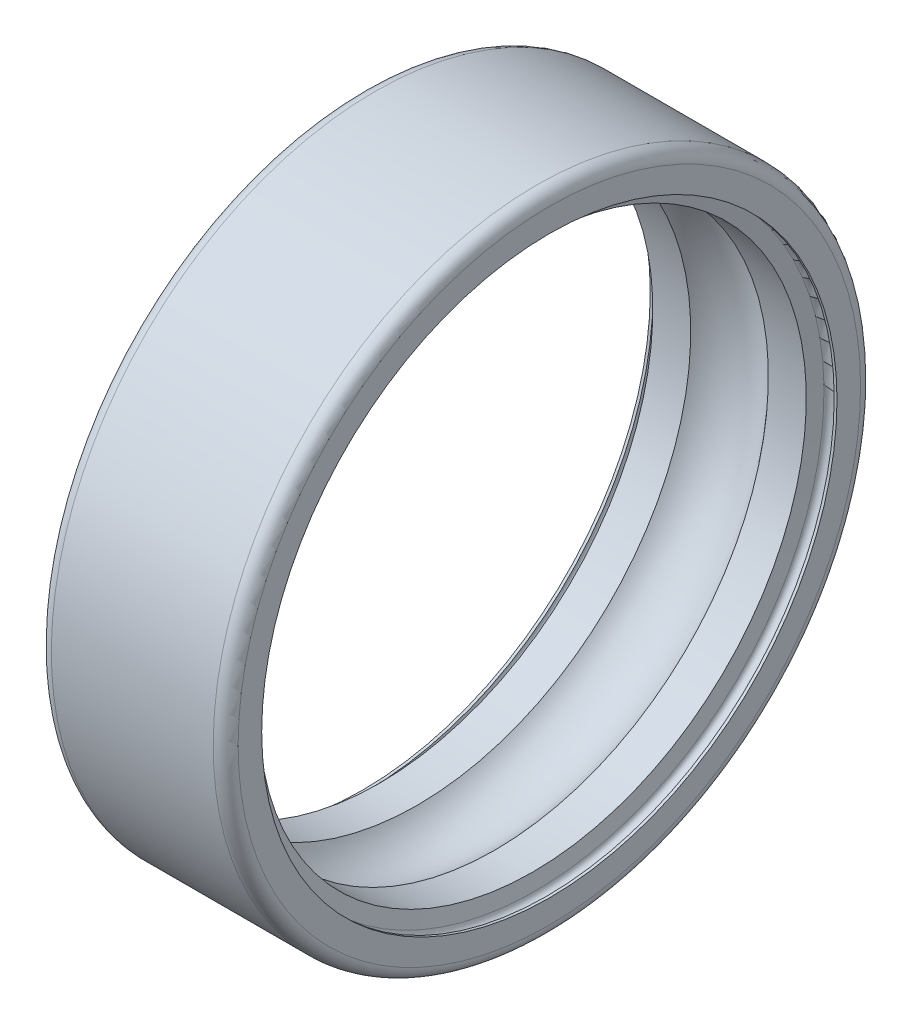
ISO-10303-21;
HEADER;
FILE_DESCRIPTION(('STEP AP214'),'2;1');
FILE_NAME('part.step','',(''),(''),'','','');
FILE_SCHEMA(('AUTOMOTIVE_DESIGN { 1 0 10303 214 1 1 1 1 }'));
ENDSEC;
DATA;
#1=APPLICATION_CONTEXT('core data for automotive mechanical design processes');
#2=APPLICATION_PROTOCOL_DEFINITION('international standard','automotive_design',2000,#1);
#3=PRODUCT_CONTEXT('',#1,'mechanical');
#4=PRODUCT('Part','Part','',(#3));
#5=PRODUCT_RELATED_PRODUCT_CATEGORY('part','',(#4));
#6=PRODUCT_DEFINITION_FORMATION('','',#4);
#7=PRODUCT_DEFINITION_CONTEXT('part definition',#1,'design');
#8=PRODUCT_DEFINITION('design','',#6,#7);
#9=PRODUCT_DEFINITION_SHAPE('','',#8);
#10=(LENGTH_UNIT() NAMED_UNIT(*) SI_UNIT(.MILLI.,.METRE.));
#11=(NAMED_UNIT(*) PLANE_ANGLE_UNIT() SI_UNIT($,.RADIAN.));
#12=(NAMED_UNIT(*) SI_UNIT($,.STERADIAN.) SOLID_ANGLE_UNIT());
#13=UNCERTAINTY_MEASURE_WITH_UNIT(LENGTH_MEASURE(1.E-05),#10,'distance_accuracy_value','');
#14=(GEOMETRIC_REPRESENTATION_CONTEXT(3) GLOBAL_UNCERTAINTY_ASSIGNED_CONTEXT((#13)) GLOBAL_UNIT_ASSIGNED_CONTEXT((#10,
#11,#12)) REPRESENTATION_CONTEXT('',''));
#15=CARTESIAN_POINT('',(0.,0.,0.));
#16=DIRECTION('',(0.,0.,1.));
#17=DIRECTION('',(1.,0.,0.));
#18=AXIS2_PLACEMENT_3D('',#15,#16,#17);
#19=CARTESIAN_POINT('',(14.322,0.,0.));
#20=DIRECTION('',(1.,0.,0.));
#21=DIRECTION('',(0.,0.,-1.));
#22=AXIS2_PLACEMENT_3D('',#19,#20,#21);
#23=TOROIDAL_SURFACE('',#22,23.105,0.452);
#24=CARTESIAN_POINT('',(14.774,0.,0.));
#25=DIRECTION('',(1.,0.,0.));
#26=DIRECTION('',(0.,1.,0.));
#27=AXIS2_PLACEMENT_3D('',#24,#25,#26);
#28=CIRCLE('',#27,23.105);
#29=CARTESIAN_POINT('',(14.774,23.105,0.));
#30=VERTEX_POINT('',#29);
#31=EDGE_CURVE('E10',#30,#30,#28,.T.);
#32=ORIENTED_EDGE('',*,*,#31,.T.);
#33=EDGE_LOOP('',(#32));
#34=FACE_BOUND('',#33,.T.);
#35=CARTESIAN_POINT('',(13.8768668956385,0.,0.));
#36=DIRECTION('',(1.,0.,0.));
#37=DIRECTION('',(0.,1.,0.));
#38=AXIS2_PLACEMENT_3D('',#35,#36,#37);
#39=CIRCLE('',#38,23.1834889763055);
#40=CARTESIAN_POINT('',(13.8768668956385,23.1834889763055,0.));
#41=VERTEX_POINT('',#40);
#42=EDGE_CURVE('E100',#41,#41,#39,.T.);
#43=ORIENTED_EDGE('',*,*,#42,.F.);
#44=EDGE_LOOP('',(#43));
#45=FACE_BOUND('',#44,.T.);
#46=ADVANCED_FACE('F15',(#34,#45),#23,.F.);
#47=CARTESIAN_POINT('',(14.887,0.,0.));
#48=DIRECTION('',(-1.,0.,0.));
#49=DIRECTION('',(0.,1.,0.));
#50=AXIS2_PLACEMENT_3D('',#47,#48,#49);
#51=CYLINDRICAL_SURFACE('',#50,23.105);
#52=CARTESIAN_POINT('',(15.,0.,0.));
#53=DIRECTION('',(1.,0.,0.));
#54=DIRECTION('',(0.,1.,0.));
#55=AXIS2_PLACEMENT_3D('',#52,#53,#54);
#56=CIRCLE('',#55,23.105);
#57=CARTESIAN_POINT('',(15.,23.105,0.));
#58=VERTEX_POINT('',#57);
#59=EDGE_CURVE('E25',#58,#58,#56,.T.);
#60=ORIENTED_EDGE('',*,*,#59,.T.);
#61=EDGE_LOOP('',(#60));
#62=FACE_BOUND('',#61,.T.);
#63=ORIENTED_EDGE('',*,*,#31,.F.);
#64=EDGE_LOOP('',(#63));
#65=FACE_BOUND('',#64,.T.);
#66=ADVANCED_FACE('F111',(#62,#65),#51,.F.);
#67=CARTESIAN_POINT('',(15.,24.0525,0.));
#68=DIRECTION('',(1.,0.,0.));
#69=DIRECTION('',(0.,1.,0.));
#70=AXIS2_PLACEMENT_3D('',#67,#68,#69);
#71=PLANE('',#70);
#72=CARTESIAN_POINT('',(15.,0.,0.));
#73=DIRECTION('',(1.,0.,0.));
#74=DIRECTION('',(0.,1.,0.));
#75=AXIS2_PLACEMENT_3D('',#72,#73,#74);
#76=CIRCLE('',#75,25.);
#77=CARTESIAN_POINT('',(15.,25.,0.));
#78=VERTEX_POINT('',#77);
#79=EDGE_CURVE('E75',#78,#78,#76,.T.);
#80=ORIENTED_EDGE('',*,*,#79,.T.);
#81=EDGE_LOOP('',(#80));
#82=FACE_BOUND('',#81,.T.);
#83=ORIENTED_EDGE('',*,*,#59,.F.);
#84=EDGE_LOOP('',(#83));
#85=FACE_BOUND('',#84,.T.);
#86=ADVANCED_FACE('F76',(#82,#85),#71,.T.);
#87=CARTESIAN_POINT('',(14.,0.,0.));
#88=DIRECTION('',(1.,0.,0.));
#89=DIRECTION('',(0.,0.,-1.));
#90=AXIS2_PLACEMENT_3D('',#87,#88,#89);
#91=TOROIDAL_SURFACE('',#90,25.,1.);
#92=CARTESIAN_POINT('',(14.,0.,0.));
#93=DIRECTION('',(1.,0.,0.));
#94=DIRECTION('',(0.,1.,0.));
#95=AXIS2_PLACEMENT_3D('',#92,#93,#94);
#96=CIRCLE('',#95,26.);
#97=CARTESIAN_POINT('',(14.,26.,0.));
#98=VERTEX_POINT('',#97);
#99=EDGE_CURVE('E79',#98,#98,#96,.T.);
#100=ORIENTED_EDGE('',*,*,#99,.T.);
#101=EDGE_LOOP('',(#100));
#102=FACE_BOUND('',#101,.T.);
#103=ORIENTED_EDGE('',*,*,#79,.F.);
#104=EDGE_LOOP('',(#103));
#105=FACE_BOUND('',#104,.T.);
#106=ADVANCED_FACE('F140',(#102,#105),#91,.T.);
#107=CARTESIAN_POINT('',(7.5,0.,0.));
#108=DIRECTION('',(-1.,0.,0.));
#109=DIRECTION('',(0.,1.,0.));
#110=AXIS2_PLACEMENT_3D('',#107,#108,#109);
#111=CYLINDRICAL_SURFACE('',#110,26.);
#112=CARTESIAN_POINT('',(1.,0.,0.));
#113=DIRECTION('',(1.,0.,0.));
#114=DIRECTION('',(0.,1.,0.));
#115=AXIS2_PLACEMENT_3D('',#112,#113,#114);
#116=CIRCLE('',#115,26.);
#117=CARTESIAN_POINT('',(1.,26.,0.));
#118=VERTEX_POINT('',#117);
#119=EDGE_CURVE('E82',#118,#118,#116,.T.);
#120=ORIENTED_EDGE('',*,*,#119,.T.);
#121=EDGE_LOOP('',(#120));
#122=FACE_BOUND('',#121,.T.);
#123=ORIENTED_EDGE('',*,*,#99,.F.);
#124=EDGE_LOOP('',(#123));
#125=FACE_BOUND('',#124,.T.);
#126=ADVANCED_FACE('F145',(#122,#125),#111,.T.);
#127=CARTESIAN_POINT('',(1.,0.,0.));
#128=DIRECTION('',(1.,0.,0.));
#129=DIRECTION('',(0.,0.,-1.));
#130=AXIS2_PLACEMENT_3D('',#127,#128,#129);
#131=TOROIDAL_SURFACE('',#130,25.,1.);
#132=CARTESIAN_POINT('',(0.,0.,0.));
#133=DIRECTION('',(1.,0.,0.));
#134=DIRECTION('',(0.,1.,0.));
#135=AXIS2_PLACEMENT_3D('',#132,#133,#134);
#136=CIRCLE('',#135,25.);
#137=CARTESIAN_POINT('',(0.,25.,0.));
#138=VERTEX_POINT('',#137);
#139=EDGE_CURVE('E45',#138,#138,#136,.T.);
#140=ORIENTED_EDGE('',*,*,#139,.T.);
#141=EDGE_LOOP('',(#140));
#142=FACE_BOUND('',#141,.T.);
#143=ORIENTED_EDGE('',*,*,#119,.F.);
#144=EDGE_LOOP('',(#143));
#145=FACE_BOUND('',#144,.T.);
#146=ADVANCED_FACE('F17',(#142,#145),#131,.T.);
#147=CARTESIAN_POINT('',(0.,24.0525,0.));
#148=DIRECTION('',(-1.,0.,0.));
#149=DIRECTION('',(0.,-1.,0.));
#150=AXIS2_PLACEMENT_3D('',#147,#148,#149);
#151=PLANE('',#150);
#152=CARTESIAN_POINT('',(0.,0.,0.));
#153=DIRECTION('',(1.,0.,0.));
#154=DIRECTION('',(0.,1.,0.));
#155=AXIS2_PLACEMENT_3D('',#152,#153,#154);
#156=CIRCLE('',#155,23.105);
#157=CARTESIAN_POINT('',(0.,23.105,0.));
#158=VERTEX_POINT('',#157);
#159=EDGE_CURVE('E19',#158,#158,#156,.T.);
#160=ORIENTED_EDGE('',*,*,#159,.T.);
#161=EDGE_LOOP('',(#160));
#162=FACE_BOUND('',#161,.T.);
#163=ORIENTED_EDGE('',*,*,#139,.F.);
#164=EDGE_LOOP('',(#163));
#165=FACE_BOUND('',#164,.T.);
#166=ADVANCED_FACE('F135',(#162,#165),#151,.T.);
#167=CARTESIAN_POINT('',(0.113,0.,0.));
#168=DIRECTION('',(-1.,0.,0.));
#169=DIRECTION('',(0.,1.,0.));
#170=AXIS2_PLACEMENT_3D('',#167,#168,#169);
#171=CYLINDRICAL_SURFACE('',#170,23.105);
#172=CARTESIAN_POINT('',(0.226,0.,0.));
#173=DIRECTION('',(1.,0.,0.));
#174=DIRECTION('',(0.,1.,0.));
#175=AXIS2_PLACEMENT_3D('',#172,#173,#174);
#176=CIRCLE('',#175,23.105);
#177=CARTESIAN_POINT('',(0.226,23.105,0.));
#178=VERTEX_POINT('',#177);
#179=EDGE_CURVE('E55',#178,#178,#176,.T.);
#180=ORIENTED_EDGE('',*,*,#179,.T.);
#181=EDGE_LOOP('',(#180));
#182=FACE_BOUND('',#181,.T.);
#183=ORIENTED_EDGE('',*,*,#159,.F.);
#184=EDGE_LOOP('',(#183));
#185=FACE_BOUND('',#184,.T.);
#186=ADVANCED_FACE('F130',(#182,#185),#171,.F.);
#187=CARTESIAN_POINT('',(0.678,0.,0.));
#188=DIRECTION('',(1.,0.,0.));
#189=DIRECTION('',(0.,0.,-1.));
#190=AXIS2_PLACEMENT_3D('',#187,#188,#189);
#191=TOROIDAL_SURFACE('',#190,23.105,0.452);
#192=CARTESIAN_POINT('',(1.12313310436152,0.,0.));
#193=DIRECTION('',(1.,0.,0.));
#194=DIRECTION('',(0.,1.,0.));
#195=AXIS2_PLACEMENT_3D('',#192,#193,#194);
#196=CIRCLE('',#195,23.1834889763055);
#197=CARTESIAN_POINT('',(1.12313310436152,23.1834889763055,0.));
#198=VERTEX_POINT('',#197);
#199=EDGE_CURVE('E92',#198,#198,#196,.T.);
#200=ORIENTED_EDGE('',*,*,#199,.T.);
#201=EDGE_LOOP('',(#200));
#202=FACE_BOUND('',#201,.T.);
#203=ORIENTED_EDGE('',*,*,#179,.F.);
#204=EDGE_LOOP('',(#203));
#205=FACE_BOUND('',#204,.T.);
#206=ADVANCED_FACE('F126',(#202,#205),#191,.F.);
#207=CARTESIAN_POINT('',(1.22967771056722,0.,0.));
#208=DIRECTION('',(-1.,0.,0.));
#209=DIRECTION('',(0.,1.,0.));
#210=AXIS2_PLACEMENT_3D('',#207,#208,#209);
#211=CONICAL_SURFACE('',#210,22.5792444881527,1.39626340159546);
#212=CARTESIAN_POINT('',(1.33622231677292,0.,0.));
#213=DIRECTION('',(1.,0.,0.));
#214=DIRECTION('',(0.,1.,0.));
#215=AXIS2_PLACEMENT_3D('',#212,#213,#214);
#216=CIRCLE('',#215,21.975);
#217=CARTESIAN_POINT('',(1.33622231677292,21.975,0.));
#218=VERTEX_POINT('',#217);
#219=EDGE_CURVE('E89',#218,#218,#216,.T.);
#220=ORIENTED_EDGE('',*,*,#219,.T.);
#221=EDGE_LOOP('',(#220));
#222=FACE_BOUND('',#221,.T.);
#223=ORIENTED_EDGE('',*,*,#199,.F.);
#224=EDGE_LOOP('',(#223));
#225=FACE_BOUND('',#224,.T.);
#226=ADVANCED_FACE('F129',(#222,#225),#211,.F.);
#227=CARTESIAN_POINT('',(2.85878951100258,0.,0.));
#228=DIRECTION('',(-1.,0.,0.));
#229=DIRECTION('',(0.,1.,0.));
#230=AXIS2_PLACEMENT_3D('',#227,#228,#229);
#231=CYLINDRICAL_SURFACE('',#230,21.975);
#232=CARTESIAN_POINT('',(4.38135670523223,0.,0.));
#233=DIRECTION('',(1.,0.,0.));
#234=DIRECTION('',(0.,1.,0.));
#235=AXIS2_PLACEMENT_3D('',#232,#233,#234);
#236=CIRCLE('',#235,21.975);
#237=CARTESIAN_POINT('',(4.38135670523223,21.975,0.));
#238=VERTEX_POINT('',#237);
#239=EDGE_CURVE('E88',#238,#238,#236,.T.);
#240=ORIENTED_EDGE('',*,*,#239,.T.);
#241=EDGE_LOOP('',(#240));
#242=FACE_BOUND('',#241,.T.);
#243=ORIENTED_EDGE('',*,*,#219,.F.);
#244=EDGE_LOOP('',(#243));
#245=FACE_BOUND('',#244,.T.);
#246=ADVANCED_FACE('F131',(#242,#245),#231,.F.);
#247=CARTESIAN_POINT('',(7.5,0.,0.));
#248=DIRECTION('',(1.,0.,0.));
#249=DIRECTION('',(0.,0.,-1.));
#250=AXIS2_PLACEMENT_3D('',#247,#248,#249);
#251=TOROIDAL_SURFACE('',#250,19.52,3.969);
#252=CARTESIAN_POINT('',(10.6186432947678,0.,0.));
#253=DIRECTION('',(1.,0.,0.));
#254=DIRECTION('',(0.,1.,0.));
#255=AXIS2_PLACEMENT_3D('',#252,#253,#254);
#256=CIRCLE('',#255,21.975);
#257=CARTESIAN_POINT('',(10.6186432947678,21.975,0.));
#258=VERTEX_POINT('',#257);
#259=EDGE_CURVE('E90',#258,#258,#256,.T.);
#260=ORIENTED_EDGE('',*,*,#259,.T.);
#261=EDGE_LOOP('',(#260));
#262=FACE_BOUND('',#261,.T.);
#263=ORIENTED_EDGE('',*,*,#239,.F.);
#264=EDGE_LOOP('',(#263));
#265=FACE_BOUND('',#264,.T.);
#266=ADVANCED_FACE('F121',(#262,#265),#251,.F.);
#267=CARTESIAN_POINT('',(12.1412104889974,0.,0.));
#268=DIRECTION('',(-1.,0.,0.));
#269=DIRECTION('',(0.,1.,0.));
#270=AXIS2_PLACEMENT_3D('',#267,#268,#269);
#271=CYLINDRICAL_SURFACE('',#270,21.975);
#272=CARTESIAN_POINT('',(13.6637776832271,0.,0.));
#273=DIRECTION('',(1.,0.,0.));
#274=DIRECTION('',(0.,1.,0.));
#275=AXIS2_PLACEMENT_3D('',#272,#273,#274);
#276=CIRCLE('',#275,21.975);
#277=CARTESIAN_POINT('',(13.6637776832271,21.975,0.));
#278=VERTEX_POINT('',#277);
#279=EDGE_CURVE('E101',#278,#278,#276,.T.);
#280=ORIENTED_EDGE('',*,*,#279,.T.);
#281=EDGE_LOOP('',(#280));
#282=FACE_BOUND('',#281,.T.);
#283=ORIENTED_EDGE('',*,*,#259,.F.);
#284=EDGE_LOOP('',(#283));
#285=FACE_BOUND('',#284,.T.);
#286=ADVANCED_FACE('F125',(#282,#285),#271,.F.);
#287=CARTESIAN_POINT('',(13.7703222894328,0.,0.));
#288=DIRECTION('',(1.,0.,0.));
#289=DIRECTION('',(0.,1.,0.));
#290=AXIS2_PLACEMENT_3D('',#287,#288,#289);
#291=CONICAL_SURFACE('',#290,22.5792444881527,1.39626340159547);
#292=ORIENTED_EDGE('',*,*,#42,.T.);
#293=EDGE_LOOP('',(#292));
#294=FACE_BOUND('',#293,.T.);
#295=ORIENTED_EDGE('',*,*,#279,.F.);
#296=EDGE_LOOP('',(#295));
#297=FACE_BOUND('',#296,.T.);
#298=ADVANCED_FACE('F107',(#294,#297),#291,.F.);
#299=CLOSED_SHELL('',(#46,#66,#86,#106,#126,#146,#166,#186,#206,#226,#246,#266,#286,#298));
#300=MANIFOLD_SOLID_BREP('B1',#299);
#301=ADVANCED_BREP_SHAPE_REPRESENTATION('',(#18,#300),#14);
#302=SHAPE_DEFINITION_REPRESENTATION(#9,#301);
ENDSEC;
END-ISO-10303-21;
